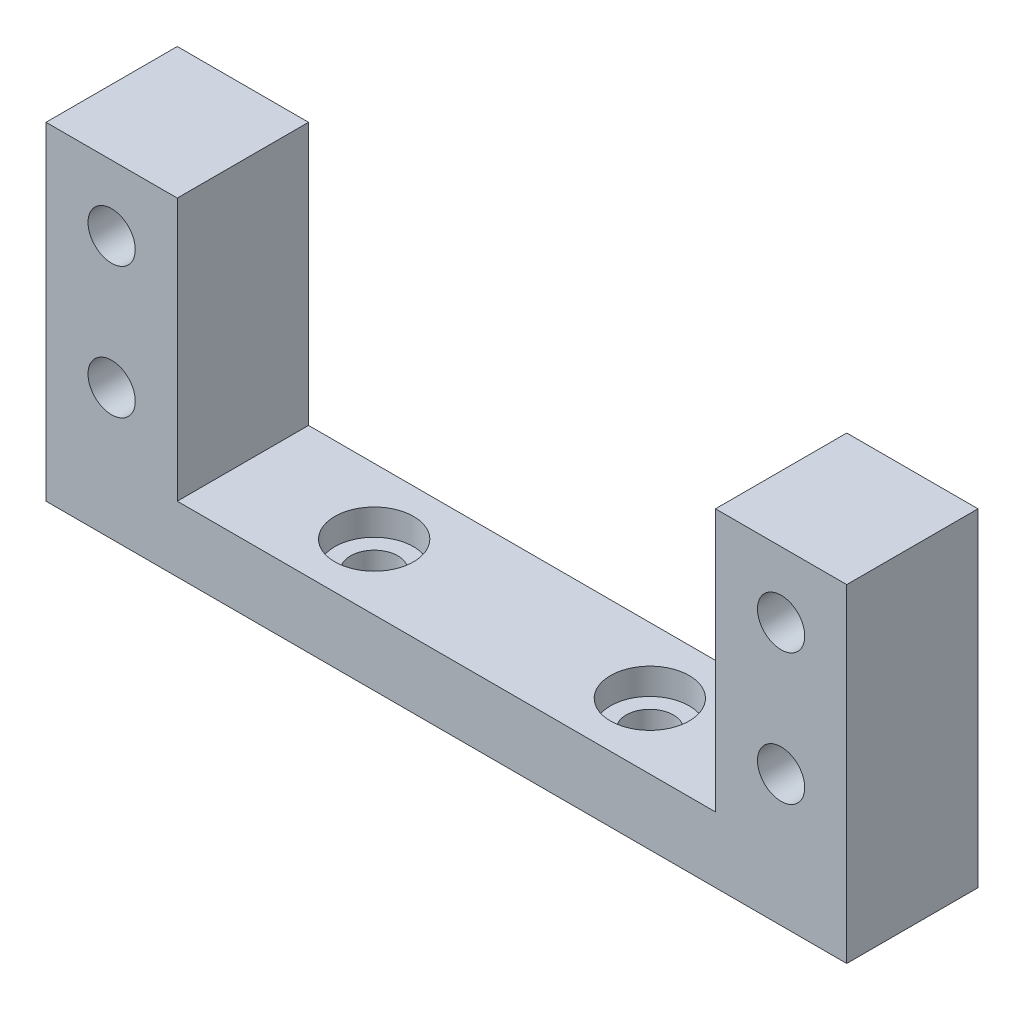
ISO-10303-21;
HEADER;
FILE_DESCRIPTION(('STEP AP214'),'2;1');
FILE_NAME('part.step','',(''),(''),'','','');
FILE_SCHEMA(('AUTOMOTIVE_DESIGN { 1 0 10303 214 1 1 1 1 }'));
ENDSEC;
DATA;
#1=APPLICATION_CONTEXT('core data for automotive mechanical design processes');
#2=APPLICATION_PROTOCOL_DEFINITION('international standard','automotive_design',2000,#1);
#3=PRODUCT_CONTEXT('',#1,'mechanical');
#4=PRODUCT('Part','Part','',(#3));
#5=PRODUCT_RELATED_PRODUCT_CATEGORY('part','',(#4));
#6=PRODUCT_DEFINITION_FORMATION('','',#4);
#7=PRODUCT_DEFINITION_CONTEXT('part definition',#1,'design');
#8=PRODUCT_DEFINITION('design','',#6,#7);
#9=PRODUCT_DEFINITION_SHAPE('','',#8);
#10=(LENGTH_UNIT() NAMED_UNIT(*) SI_UNIT(.MILLI.,.METRE.));
#11=(NAMED_UNIT(*) PLANE_ANGLE_UNIT() SI_UNIT($,.RADIAN.));
#12=(NAMED_UNIT(*) SI_UNIT($,.STERADIAN.) SOLID_ANGLE_UNIT());
#13=UNCERTAINTY_MEASURE_WITH_UNIT(LENGTH_MEASURE(1.E-05),#10,'distance_accuracy_value','');
#14=(GEOMETRIC_REPRESENTATION_CONTEXT(3) GLOBAL_UNCERTAINTY_ASSIGNED_CONTEXT((#13)) GLOBAL_UNIT_ASSIGNED_CONTEXT((#10,
#11,#12)) REPRESENTATION_CONTEXT('',''));
#15=CARTESIAN_POINT('',(0.,0.,0.));
#16=DIRECTION('',(0.,0.,1.));
#17=DIRECTION('',(1.,0.,0.));
#18=AXIS2_PLACEMENT_3D('',#15,#16,#17);
#19=CARTESIAN_POINT('',(31.,9.99999999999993,5.));
#20=DIRECTION('',(0.,-1.,0.));
#21=DIRECTION('',(1.,0.,0.));
#22=AXIS2_PLACEMENT_3D('',#19,#20,#21);
#23=CYLINDRICAL_SURFACE('',#22,1.8);
#24=CARTESIAN_POINT('',(31.,0.,5.));
#25=DIRECTION('',(0.,-1.,0.));
#26=DIRECTION('',(1.,0.,0.));
#27=AXIS2_PLACEMENT_3D('',#24,#25,#26);
#28=CIRCLE('',#27,1.8);
#29=CARTESIAN_POINT('',(32.8,0.,5.));
#30=VERTEX_POINT('',#29);
#31=EDGE_CURVE('E197',#30,#30,#28,.T.);
#32=ORIENTED_EDGE('',*,*,#31,.T.);
#33=EDGE_LOOP('',(#32));
#34=FACE_BOUND('',#33,.T.);
#35=CARTESIAN_POINT('',(31.,2.99999999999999,5.));
#36=DIRECTION('',(0.,1.,0.));
#37=DIRECTION('',(-1.,0.,0.));
#38=AXIS2_PLACEMENT_3D('',#35,#36,#37);
#39=CIRCLE('',#38,1.8);
#40=CARTESIAN_POINT('',(29.2,2.99999999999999,5.));
#41=VERTEX_POINT('',#40);
#42=EDGE_CURVE('E47',#41,#41,#39,.F.);
#43=ORIENTED_EDGE('',*,*,#42,.F.);
#44=EDGE_LOOP('',(#43));
#45=FACE_BOUND('',#44,.T.);
#46=ADVANCED_FACE('F43',(#34,#45),#23,.F.);
#47=CARTESIAN_POINT('',(10.,9.99999999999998,5.));
#48=DIRECTION('',(0.,-1.,0.));
#49=DIRECTION('',(1.,0.,0.));
#50=AXIS2_PLACEMENT_3D('',#47,#48,#49);
#51=CYLINDRICAL_SURFACE('',#50,1.8);
#52=CARTESIAN_POINT('',(9.99999999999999,0.,5.));
#53=DIRECTION('',(0.,-1.,0.));
#54=DIRECTION('',(1.,0.,0.));
#55=AXIS2_PLACEMENT_3D('',#52,#53,#54);
#56=CIRCLE('',#55,1.8);
#57=CARTESIAN_POINT('',(11.8,0.,5.));
#58=VERTEX_POINT('',#57);
#59=EDGE_CURVE('E154',#58,#58,#56,.T.);
#60=ORIENTED_EDGE('',*,*,#59,.T.);
#61=EDGE_LOOP('',(#60));
#62=FACE_BOUND('',#61,.T.);
#63=CARTESIAN_POINT('',(10.,3.,5.));
#64=DIRECTION('',(0.,1.,0.));
#65=DIRECTION('',(-1.,0.,0.));
#66=AXIS2_PLACEMENT_3D('',#63,#64,#65);
#67=CIRCLE('',#66,1.8);
#68=CARTESIAN_POINT('',(8.2,3.,5.));
#69=VERTEX_POINT('',#68);
#70=EDGE_CURVE('E191',#69,#69,#67,.F.);
#71=ORIENTED_EDGE('',*,*,#70,.F.);
#72=EDGE_LOOP('',(#71));
#73=FACE_BOUND('',#72,.T.);
#74=ADVANCED_FACE('F252',(#62,#73),#51,.F.);
#75=CARTESIAN_POINT('',(-9.99999999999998,0.,10.));
#76=DIRECTION('',(1.,0.,0.));
#77=DIRECTION('',(0.,0.,-1.));
#78=AXIS2_PLACEMENT_3D('',#75,#76,#77);
#79=PLANE('',#78);
#80=DIRECTION('',(0.,-1.,0.));
#81=VECTOR('',#80,1.);
#82=CARTESIAN_POINT('',(-9.99999999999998,0.,0.));
#83=LINE('',#82,#81);
#84=CARTESIAN_POINT('',(-9.99999999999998,25.,0.));
#85=VERTEX_POINT('',#84);
#86=CARTESIAN_POINT('',(-9.99999999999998,0.,0.));
#87=VERTEX_POINT('',#86);
#88=EDGE_CURVE('E157',#85,#87,#83,.T.);
#89=ORIENTED_EDGE('',*,*,#88,.T.);
#90=DIRECTION('',(0.,0.,-1.));
#91=VECTOR('',#90,1.);
#92=CARTESIAN_POINT('',(-9.99999999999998,0.,10.));
#93=LINE('',#92,#91);
#94=CARTESIAN_POINT('',(-9.99999999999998,0.,10.));
#95=VERTEX_POINT('',#94);
#96=EDGE_CURVE('E11',#95,#87,#93,.T.);
#97=ORIENTED_EDGE('',*,*,#96,.F.);
#98=DIRECTION('',(0.,-1.,0.));
#99=VECTOR('',#98,1.);
#100=CARTESIAN_POINT('',(-9.99999999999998,0.,10.));
#101=LINE('',#100,#99);
#102=CARTESIAN_POINT('',(-9.99999999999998,25.,10.));
#103=VERTEX_POINT('',#102);
#104=EDGE_CURVE('E221',#103,#95,#101,.T.);
#105=ORIENTED_EDGE('',*,*,#104,.F.);
#106=DIRECTION('',(0.,0.,-1.));
#107=VECTOR('',#106,1.);
#108=CARTESIAN_POINT('',(-9.99999999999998,25.,10.));
#109=LINE('',#108,#107);
#110=EDGE_CURVE('E62',#103,#85,#109,.T.);
#111=ORIENTED_EDGE('',*,*,#110,.T.);
#112=EDGE_LOOP('',(#89,#97,#105,#111));
#113=FACE_BOUND('',#112,.T.);
#114=ADVANCED_FACE('F258',(#113),#79,.F.);
#115=CARTESIAN_POINT('',(0.,0.,10.));
#116=DIRECTION('',(0.,1.,0.));
#117=DIRECTION('',(-1.,0.,0.));
#118=AXIS2_PLACEMENT_3D('',#115,#116,#117);
#119=PLANE('',#118);
#120=ORIENTED_EDGE('',*,*,#59,.F.);
#121=EDGE_LOOP('',(#120));
#122=FACE_BOUND('',#121,.T.);
#123=ORIENTED_EDGE('',*,*,#31,.F.);
#124=EDGE_LOOP('',(#123));
#125=FACE_BOUND('',#124,.T.);
#126=DIRECTION('',(1.,0.,0.));
#127=VECTOR('',#126,1.);
#128=CARTESIAN_POINT('',(0.,0.,0.));
#129=LINE('',#128,#127);
#130=CARTESIAN_POINT('',(51.,0.,0.));
#131=VERTEX_POINT('',#130);
#132=EDGE_CURVE('E159',#87,#131,#129,.T.);
#133=ORIENTED_EDGE('',*,*,#132,.T.);
#134=DIRECTION('',(0.,0.,-1.));
#135=VECTOR('',#134,1.);
#136=CARTESIAN_POINT('',(51.,0.,10.));
#137=LINE('',#136,#135);
#138=CARTESIAN_POINT('',(51.,0.,10.));
#139=VERTEX_POINT('',#138);
#140=EDGE_CURVE('E53',#139,#131,#137,.T.);
#141=ORIENTED_EDGE('',*,*,#140,.F.);
#142=DIRECTION('',(1.,0.,0.));
#143=VECTOR('',#142,1.);
#144=CARTESIAN_POINT('',(0.,0.,10.));
#145=LINE('',#144,#143);
#146=EDGE_CURVE('E100',#95,#139,#145,.T.);
#147=ORIENTED_EDGE('',*,*,#146,.F.);
#148=ORIENTED_EDGE('',*,*,#96,.T.);
#149=EDGE_LOOP('',(#133,#141,#147,#148));
#150=FACE_BOUND('',#149,.T.);
#151=ADVANCED_FACE('F452',(#122,#125,#150),#119,.F.);
#152=CARTESIAN_POINT('',(51.,0.,10.));
#153=DIRECTION('',(1.,0.,0.));
#154=DIRECTION('',(0.,1.,0.));
#155=AXIS2_PLACEMENT_3D('',#152,#153,#154);
#156=PLANE('',#155);
#157=DIRECTION('',(0.,-1.,0.));
#158=VECTOR('',#157,1.);
#159=CARTESIAN_POINT('',(51.,0.,0.));
#160=LINE('',#159,#158);
#161=CARTESIAN_POINT('',(51.,25.,0.));
#162=VERTEX_POINT('',#161);
#163=EDGE_CURVE('E162',#162,#131,#160,.T.);
#164=ORIENTED_EDGE('',*,*,#163,.F.);
#165=DIRECTION('',(0.,0.,-1.));
#166=VECTOR('',#165,1.);
#167=CARTESIAN_POINT('',(51.,25.,10.));
#168=LINE('',#167,#166);
#169=CARTESIAN_POINT('',(51.,25.,10.));
#170=VERTEX_POINT('',#169);
#171=EDGE_CURVE('E189',#170,#162,#168,.T.);
#172=ORIENTED_EDGE('',*,*,#171,.F.);
#173=DIRECTION('',(0.,-1.,0.));
#174=VECTOR('',#173,1.);
#175=CARTESIAN_POINT('',(51.,0.,10.));
#176=LINE('',#175,#174);
#177=EDGE_CURVE('E224',#170,#139,#176,.T.);
#178=ORIENTED_EDGE('',*,*,#177,.T.);
#179=ORIENTED_EDGE('',*,*,#140,.T.);
#180=EDGE_LOOP('',(#164,#172,#178,#179));
#181=FACE_BOUND('',#180,.T.);
#182=ADVANCED_FACE('F235',(#181),#156,.T.);
#183=CARTESIAN_POINT('',(0.,25.,10.));
#184=DIRECTION('',(0.,1.,0.));
#185=DIRECTION('',(0.,0.,1.));
#186=AXIS2_PLACEMENT_3D('',#183,#184,#185);
#187=PLANE('',#186);
#188=DIRECTION('',(1.,0.,0.));
#189=VECTOR('',#188,1.);
#190=CARTESIAN_POINT('',(0.,25.,0.));
#191=LINE('',#190,#189);
#192=CARTESIAN_POINT('',(41.,25.,0.));
#193=VERTEX_POINT('',#192);
#194=EDGE_CURVE('E165',#193,#162,#191,.T.);
#195=ORIENTED_EDGE('',*,*,#194,.F.);
#196=DIRECTION('',(0.,0.,-1.));
#197=VECTOR('',#196,1.);
#198=CARTESIAN_POINT('',(41.,25.,10.));
#199=LINE('',#198,#197);
#200=CARTESIAN_POINT('',(41.,25.,10.));
#201=VERTEX_POINT('',#200);
#202=EDGE_CURVE('E187',#201,#193,#199,.T.);
#203=ORIENTED_EDGE('',*,*,#202,.F.);
#204=DIRECTION('',(1.,0.,0.));
#205=VECTOR('',#204,1.);
#206=CARTESIAN_POINT('',(0.,25.,10.));
#207=LINE('',#206,#205);
#208=EDGE_CURVE('E227',#201,#170,#207,.T.);
#209=ORIENTED_EDGE('',*,*,#208,.T.);
#210=ORIENTED_EDGE('',*,*,#171,.T.);
#211=EDGE_LOOP('',(#195,#203,#209,#210));
#212=FACE_BOUND('',#211,.T.);
#213=ADVANCED_FACE('F231',(#212),#187,.T.);
#214=CARTESIAN_POINT('',(41.,0.,10.));
#215=DIRECTION('',(1.,0.,0.));
#216=DIRECTION('',(0.,1.,0.));
#217=AXIS2_PLACEMENT_3D('',#214,#215,#216);
#218=PLANE('',#217);
#219=DIRECTION('',(0.,-1.,0.));
#220=VECTOR('',#219,1.);
#221=CARTESIAN_POINT('',(41.,0.,0.));
#222=LINE('',#221,#220);
#223=CARTESIAN_POINT('',(41.,5.,0.));
#224=VERTEX_POINT('',#223);
#225=EDGE_CURVE('E168',#193,#224,#222,.T.);
#226=ORIENTED_EDGE('',*,*,#225,.T.);
#227=DIRECTION('',(0.,0.,-1.));
#228=VECTOR('',#227,1.);
#229=CARTESIAN_POINT('',(41.,5.,10.));
#230=LINE('',#229,#228);
#231=CARTESIAN_POINT('',(41.,5.,10.));
#232=VERTEX_POINT('',#231);
#233=EDGE_CURVE('E125',#232,#224,#230,.T.);
#234=ORIENTED_EDGE('',*,*,#233,.F.);
#235=DIRECTION('',(0.,-1.,0.));
#236=VECTOR('',#235,1.);
#237=CARTESIAN_POINT('',(41.,0.,10.));
#238=LINE('',#237,#236);
#239=EDGE_CURVE('E135',#201,#232,#238,.T.);
#240=ORIENTED_EDGE('',*,*,#239,.F.);
#241=ORIENTED_EDGE('',*,*,#202,.T.);
#242=EDGE_LOOP('',(#226,#234,#240,#241));
#243=FACE_BOUND('',#242,.T.);
#244=ADVANCED_FACE('F241',(#243),#218,.F.);
#245=CARTESIAN_POINT('',(0.,5.,10.));
#246=DIRECTION('',(0.,1.,0.));
#247=DIRECTION('',(-1.,0.,0.));
#248=AXIS2_PLACEMENT_3D('',#245,#246,#247);
#249=PLANE('',#248);
#250=CARTESIAN_POINT('',(10.,5.,5.));
#251=DIRECTION('',(0.,1.,0.));
#252=DIRECTION('',(-1.,0.,0.));
#253=AXIS2_PLACEMENT_3D('',#250,#251,#252);
#254=CIRCLE('',#253,3.);
#255=CARTESIAN_POINT('',(7.,5.,5.));
#256=VERTEX_POINT('',#255);
#257=EDGE_CURVE('E199',#256,#256,#254,.T.);
#258=ORIENTED_EDGE('',*,*,#257,.F.);
#259=EDGE_LOOP('',(#258));
#260=FACE_BOUND('',#259,.T.);
#261=CARTESIAN_POINT('',(31.,4.99999999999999,5.));
#262=DIRECTION('',(0.,1.,0.));
#263=DIRECTION('',(-1.,0.,0.));
#264=AXIS2_PLACEMENT_3D('',#261,#262,#263);
#265=CIRCLE('',#264,3.);
#266=CARTESIAN_POINT('',(28.,4.99999999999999,5.));
#267=VERTEX_POINT('',#266);
#268=EDGE_CURVE('E204',#267,#267,#265,.T.);
#269=ORIENTED_EDGE('',*,*,#268,.F.);
#270=EDGE_LOOP('',(#269));
#271=FACE_BOUND('',#270,.T.);
#272=DIRECTION('',(1.,0.,0.));
#273=VECTOR('',#272,1.);
#274=CARTESIAN_POINT('',(0.,5.,0.));
#275=LINE('',#274,#273);
#276=CARTESIAN_POINT('',(0.,5.,0.));
#277=VERTEX_POINT('',#276);
#278=EDGE_CURVE('E121',#277,#224,#275,.T.);
#279=ORIENTED_EDGE('',*,*,#278,.F.);
#280=DIRECTION('',(0.,0.,-1.));
#281=VECTOR('',#280,1.);
#282=CARTESIAN_POINT('',(0.,5.,10.));
#283=LINE('',#282,#281);
#284=CARTESIAN_POINT('',(0.,5.,10.));
#285=VERTEX_POINT('',#284);
#286=EDGE_CURVE('E116',#285,#277,#283,.T.);
#287=ORIENTED_EDGE('',*,*,#286,.F.);
#288=DIRECTION('',(1.,0.,0.));
#289=VECTOR('',#288,1.);
#290=CARTESIAN_POINT('',(0.,5.,10.));
#291=LINE('',#290,#289);
#292=EDGE_CURVE('E119',#285,#232,#291,.T.);
#293=ORIENTED_EDGE('',*,*,#292,.T.);
#294=ORIENTED_EDGE('',*,*,#233,.T.);
#295=EDGE_LOOP('',(#279,#287,#293,#294));
#296=FACE_BOUND('',#295,.T.);
#297=ADVANCED_FACE('F118',(#260,#271,#296),#249,.T.);
#298=CARTESIAN_POINT('',(0.,0.,10.));
#299=DIRECTION('',(1.,0.,0.));
#300=DIRECTION('',(0.,1.,0.));
#301=AXIS2_PLACEMENT_3D('',#298,#299,#300);
#302=PLANE('',#301);
#303=DIRECTION('',(0.,-1.,0.));
#304=VECTOR('',#303,1.);
#305=CARTESIAN_POINT('',(0.,0.,0.));
#306=LINE('',#305,#304);
#307=CARTESIAN_POINT('',(0.,25.,0.));
#308=VERTEX_POINT('',#307);
#309=EDGE_CURVE('E172',#308,#277,#306,.T.);
#310=ORIENTED_EDGE('',*,*,#309,.F.);
#311=DIRECTION('',(0.,0.,-1.));
#312=VECTOR('',#311,1.);
#313=CARTESIAN_POINT('',(0.,25.,10.));
#314=LINE('',#313,#312);
#315=CARTESIAN_POINT('',(0.,25.,10.));
#316=VERTEX_POINT('',#315);
#317=EDGE_CURVE('E88',#316,#308,#314,.T.);
#318=ORIENTED_EDGE('',*,*,#317,.F.);
#319=DIRECTION('',(0.,-1.,0.));
#320=VECTOR('',#319,1.);
#321=CARTESIAN_POINT('',(0.,0.,10.));
#322=LINE('',#321,#320);
#323=EDGE_CURVE('E132',#316,#285,#322,.T.);
#324=ORIENTED_EDGE('',*,*,#323,.T.);
#325=ORIENTED_EDGE('',*,*,#286,.T.);
#326=EDGE_LOOP('',(#310,#318,#324,#325));
#327=FACE_BOUND('',#326,.T.);
#328=ADVANCED_FACE('F138',(#327),#302,.T.);
#329=CARTESIAN_POINT('',(46.,9.99999999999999,10.));
#330=DIRECTION('',(0.,0.,-1.));
#331=DIRECTION('',(-1.,0.,0.));
#332=AXIS2_PLACEMENT_3D('',#329,#330,#331);
#333=CYLINDRICAL_SURFACE('',#332,1.8);
#334=CARTESIAN_POINT('',(46.,9.99999999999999,10.));
#335=DIRECTION('',(0.,0.,1.));
#336=DIRECTION('',(1.,0.,0.));
#337=AXIS2_PLACEMENT_3D('',#334,#335,#336);
#338=CIRCLE('',#337,1.8);
#339=CARTESIAN_POINT('',(47.8,9.99999999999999,10.));
#340=VERTEX_POINT('',#339);
#341=EDGE_CURVE('E141',#340,#340,#338,.T.);
#342=ORIENTED_EDGE('',*,*,#341,.T.);
#343=EDGE_LOOP('',(#342));
#344=FACE_BOUND('',#343,.T.);
#345=CARTESIAN_POINT('',(46.,9.99999999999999,0.));
#346=DIRECTION('',(0.,0.,1.));
#347=DIRECTION('',(1.,0.,0.));
#348=AXIS2_PLACEMENT_3D('',#345,#346,#347);
#349=CIRCLE('',#348,1.8);
#350=CARTESIAN_POINT('',(47.8,9.99999999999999,0.));
#351=VERTEX_POINT('',#350);
#352=EDGE_CURVE('E177',#351,#351,#349,.T.);
#353=ORIENTED_EDGE('',*,*,#352,.F.);
#354=EDGE_LOOP('',(#353));
#355=FACE_BOUND('',#354,.T.);
#356=ADVANCED_FACE('F275',(#344,#355),#333,.F.);
#357=CARTESIAN_POINT('',(0.,25.,10.));
#358=DIRECTION('',(0.,1.,0.));
#359=DIRECTION('',(-1.,0.,0.));
#360=AXIS2_PLACEMENT_3D('',#357,#358,#359);
#361=PLANE('',#360);
#362=DIRECTION('',(1.,0.,0.));
#363=VECTOR('',#362,1.);
#364=CARTESIAN_POINT('',(0.,25.,0.));
#365=LINE('',#364,#363);
#366=EDGE_CURVE('E174',#85,#308,#365,.T.);
#367=ORIENTED_EDGE('',*,*,#366,.F.);
#368=ORIENTED_EDGE('',*,*,#110,.F.);
#369=DIRECTION('',(1.,0.,0.));
#370=VECTOR('',#369,1.);
#371=CARTESIAN_POINT('',(0.,25.,10.));
#372=LINE('',#371,#370);
#373=EDGE_CURVE('E139',#103,#316,#372,.T.);
#374=ORIENTED_EDGE('',*,*,#373,.T.);
#375=ORIENTED_EDGE('',*,*,#317,.T.);
#376=EDGE_LOOP('',(#367,#368,#374,#375));
#377=FACE_BOUND('',#376,.T.);
#378=ADVANCED_FACE('F278',(#377),#361,.T.);
#379=CARTESIAN_POINT('',(-5.,20.,10.));
#380=DIRECTION('',(0.,0.,-1.));
#381=DIRECTION('',(-1.,0.,0.));
#382=AXIS2_PLACEMENT_3D('',#379,#380,#381);
#383=CYLINDRICAL_SURFACE('',#382,1.8);
#384=CARTESIAN_POINT('',(-5.,20.,10.));
#385=DIRECTION('',(0.,0.,1.));
#386=DIRECTION('',(1.,0.,0.));
#387=AXIS2_PLACEMENT_3D('',#384,#385,#386);
#388=CIRCLE('',#387,1.8);
#389=CARTESIAN_POINT('',(-3.2,20.,10.));
#390=VERTEX_POINT('',#389);
#391=EDGE_CURVE('E218',#390,#390,#388,.T.);
#392=ORIENTED_EDGE('',*,*,#391,.T.);
#393=EDGE_LOOP('',(#392));
#394=FACE_BOUND('',#393,.T.);
#395=CARTESIAN_POINT('',(-5.,20.,0.));
#396=DIRECTION('',(0.,0.,1.));
#397=DIRECTION('',(1.,0.,0.));
#398=AXIS2_PLACEMENT_3D('',#395,#396,#397);
#399=CIRCLE('',#398,1.8);
#400=CARTESIAN_POINT('',(-3.2,20.,0.));
#401=VERTEX_POINT('',#400);
#402=EDGE_CURVE('E153',#401,#401,#399,.T.);
#403=ORIENTED_EDGE('',*,*,#402,.F.);
#404=EDGE_LOOP('',(#403));
#405=FACE_BOUND('',#404,.T.);
#406=ADVANCED_FACE('F282',(#394,#405),#383,.F.);
#407=CARTESIAN_POINT('',(-5.,10.,10.));
#408=DIRECTION('',(0.,0.,-1.));
#409=DIRECTION('',(-1.,0.,0.));
#410=AXIS2_PLACEMENT_3D('',#407,#408,#409);
#411=CYLINDRICAL_SURFACE('',#410,1.8);
#412=CARTESIAN_POINT('',(-5.,10.,10.));
#413=DIRECTION('',(0.,0.,1.));
#414=DIRECTION('',(1.,0.,0.));
#415=AXIS2_PLACEMENT_3D('',#412,#413,#414);
#416=CIRCLE('',#415,1.8);
#417=CARTESIAN_POINT('',(-3.2,10.,10.));
#418=VERTEX_POINT('',#417);
#419=EDGE_CURVE('E183',#418,#418,#416,.T.);
#420=ORIENTED_EDGE('',*,*,#419,.T.);
#421=EDGE_LOOP('',(#420));
#422=FACE_BOUND('',#421,.T.);
#423=CARTESIAN_POINT('',(-5.,10.,0.));
#424=DIRECTION('',(0.,0.,1.));
#425=DIRECTION('',(1.,0.,0.));
#426=AXIS2_PLACEMENT_3D('',#423,#424,#425);
#427=CIRCLE('',#426,1.8);
#428=CARTESIAN_POINT('',(-3.2,10.,0.));
#429=VERTEX_POINT('',#428);
#430=EDGE_CURVE('E150',#429,#429,#427,.T.);
#431=ORIENTED_EDGE('',*,*,#430,.F.);
#432=EDGE_LOOP('',(#431));
#433=FACE_BOUND('',#432,.T.);
#434=ADVANCED_FACE('F45',(#422,#433),#411,.F.);
#435=CARTESIAN_POINT('',(46.,20.,10.));
#436=DIRECTION('',(0.,0.,-1.));
#437=DIRECTION('',(-1.,0.,0.));
#438=AXIS2_PLACEMENT_3D('',#435,#436,#437);
#439=CYLINDRICAL_SURFACE('',#438,1.8);
#440=CARTESIAN_POINT('',(46.,20.,10.));
#441=DIRECTION('',(0.,0.,1.));
#442=DIRECTION('',(1.,0.,0.));
#443=AXIS2_PLACEMENT_3D('',#440,#441,#442);
#444=CIRCLE('',#443,1.8);
#445=CARTESIAN_POINT('',(47.8,20.,10.));
#446=VERTEX_POINT('',#445);
#447=EDGE_CURVE('E147',#446,#446,#444,.T.);
#448=ORIENTED_EDGE('',*,*,#447,.T.);
#449=EDGE_LOOP('',(#448));
#450=FACE_BOUND('',#449,.T.);
#451=CARTESIAN_POINT('',(46.,20.,0.));
#452=DIRECTION('',(0.,0.,1.));
#453=DIRECTION('',(1.,0.,0.));
#454=AXIS2_PLACEMENT_3D('',#451,#452,#453);
#455=CIRCLE('',#454,1.8);
#456=CARTESIAN_POINT('',(47.8,20.,0.));
#457=VERTEX_POINT('',#456);
#458=EDGE_CURVE('E180',#457,#457,#455,.T.);
#459=ORIENTED_EDGE('',*,*,#458,.F.);
#460=EDGE_LOOP('',(#459));
#461=FACE_BOUND('',#460,.T.);
#462=ADVANCED_FACE('F266',(#450,#461),#439,.F.);
#463=CARTESIAN_POINT('',(0.,0.,10.));
#464=DIRECTION('',(0.,0.,1.));
#465=DIRECTION('',(1.,0.,0.));
#466=AXIS2_PLACEMENT_3D('',#463,#464,#465);
#467=PLANE('',#466);
#468=ORIENTED_EDGE('',*,*,#419,.F.);
#469=EDGE_LOOP('',(#468));
#470=FACE_BOUND('',#469,.T.);
#471=ORIENTED_EDGE('',*,*,#391,.F.);
#472=EDGE_LOOP('',(#471));
#473=FACE_BOUND('',#472,.T.);
#474=ORIENTED_EDGE('',*,*,#104,.T.);
#475=ORIENTED_EDGE('',*,*,#146,.T.);
#476=ORIENTED_EDGE('',*,*,#177,.F.);
#477=ORIENTED_EDGE('',*,*,#208,.F.);
#478=ORIENTED_EDGE('',*,*,#239,.T.);
#479=ORIENTED_EDGE('',*,*,#292,.F.);
#480=ORIENTED_EDGE('',*,*,#323,.F.);
#481=ORIENTED_EDGE('',*,*,#373,.F.);
#482=EDGE_LOOP('',(#474,#475,#476,#477,#478,#479,#480,#481));
#483=FACE_BOUND('',#482,.T.);
#484=ORIENTED_EDGE('',*,*,#341,.F.);
#485=EDGE_LOOP('',(#484));
#486=FACE_BOUND('',#485,.T.);
#487=ORIENTED_EDGE('',*,*,#447,.F.);
#488=EDGE_LOOP('',(#487));
#489=FACE_BOUND('',#488,.T.);
#490=ADVANCED_FACE('F129',(#470,#473,#483,#486,#489),#467,.T.);
#491=CARTESIAN_POINT('',(0.,0.,0.));
#492=DIRECTION('',(0.,0.,1.));
#493=DIRECTION('',(1.,0.,0.));
#494=AXIS2_PLACEMENT_3D('',#491,#492,#493);
#495=PLANE('',#494);
#496=ORIENTED_EDGE('',*,*,#430,.T.);
#497=EDGE_LOOP('',(#496));
#498=FACE_BOUND('',#497,.T.);
#499=ORIENTED_EDGE('',*,*,#402,.T.);
#500=EDGE_LOOP('',(#499));
#501=FACE_BOUND('',#500,.T.);
#502=ORIENTED_EDGE('',*,*,#88,.F.);
#503=ORIENTED_EDGE('',*,*,#366,.T.);
#504=ORIENTED_EDGE('',*,*,#309,.T.);
#505=ORIENTED_EDGE('',*,*,#278,.T.);
#506=ORIENTED_EDGE('',*,*,#225,.F.);
#507=ORIENTED_EDGE('',*,*,#194,.T.);
#508=ORIENTED_EDGE('',*,*,#163,.T.);
#509=ORIENTED_EDGE('',*,*,#132,.F.);
#510=EDGE_LOOP('',(#502,#503,#504,#505,#506,#507,#508,#509));
#511=FACE_BOUND('',#510,.T.);
#512=ORIENTED_EDGE('',*,*,#352,.T.);
#513=EDGE_LOOP('',(#512));
#514=FACE_BOUND('',#513,.T.);
#515=ORIENTED_EDGE('',*,*,#458,.T.);
#516=EDGE_LOOP('',(#515));
#517=FACE_BOUND('',#516,.T.);
#518=ADVANCED_FACE('F238',(#498,#501,#511,#514,#517),#495,.F.);
#519=CARTESIAN_POINT('',(10.,3.,5.));
#520=DIRECTION('',(0.,1.,0.));
#521=DIRECTION('',(-1.,0.,0.));
#522=AXIS2_PLACEMENT_3D('',#519,#520,#521);
#523=PLANE('',#522);
#524=CARTESIAN_POINT('',(10.,3.,5.));
#525=DIRECTION('',(0.,1.,0.));
#526=DIRECTION('',(-1.,0.,0.));
#527=AXIS2_PLACEMENT_3D('',#524,#525,#526);
#528=CIRCLE('',#527,3.);
#529=CARTESIAN_POINT('',(7.,3.,5.));
#530=VERTEX_POINT('',#529);
#531=EDGE_CURVE('E193',#530,#530,#528,.T.);
#532=ORIENTED_EDGE('',*,*,#531,.T.);
#533=EDGE_LOOP('',(#532));
#534=FACE_BOUND('',#533,.T.);
#535=ORIENTED_EDGE('',*,*,#70,.T.);
#536=EDGE_LOOP('',(#535));
#537=FACE_BOUND('',#536,.T.);
#538=ADVANCED_FACE('F270',(#534,#537),#523,.T.);
#539=CARTESIAN_POINT('',(10.,3.,5.));
#540=DIRECTION('',(0.,1.,0.));
#541=DIRECTION('',(-1.,0.,0.));
#542=AXIS2_PLACEMENT_3D('',#539,#540,#541);
#543=CYLINDRICAL_SURFACE('',#542,3.);
#544=ORIENTED_EDGE('',*,*,#531,.F.);
#545=EDGE_LOOP('',(#544));
#546=FACE_BOUND('',#545,.T.);
#547=ORIENTED_EDGE('',*,*,#257,.T.);
#548=EDGE_LOOP('',(#547));
#549=FACE_BOUND('',#548,.T.);
#550=ADVANCED_FACE('F327',(#546,#549),#543,.F.);
#551=CARTESIAN_POINT('',(31.,2.99999999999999,5.));
#552=DIRECTION('',(0.,1.,0.));
#553=DIRECTION('',(-1.,0.,0.));
#554=AXIS2_PLACEMENT_3D('',#551,#552,#553);
#555=PLANE('',#554);
#556=CARTESIAN_POINT('',(31.,2.99999999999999,5.));
#557=DIRECTION('',(0.,1.,0.));
#558=DIRECTION('',(-1.,0.,0.));
#559=AXIS2_PLACEMENT_3D('',#556,#557,#558);
#560=CIRCLE('',#559,3.);
#561=CARTESIAN_POINT('',(28.,2.99999999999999,5.));
#562=VERTEX_POINT('',#561);
#563=EDGE_CURVE('E209',#562,#562,#560,.T.);
#564=ORIENTED_EDGE('',*,*,#563,.T.);
#565=EDGE_LOOP('',(#564));
#566=FACE_BOUND('',#565,.T.);
#567=ORIENTED_EDGE('',*,*,#42,.T.);
#568=EDGE_LOOP('',(#567));
#569=FACE_BOUND('',#568,.T.);
#570=ADVANCED_FACE('F334',(#566,#569),#555,.T.);
#571=CARTESIAN_POINT('',(31.,2.99999999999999,5.));
#572=DIRECTION('',(0.,1.,0.));
#573=DIRECTION('',(-1.,0.,0.));
#574=AXIS2_PLACEMENT_3D('',#571,#572,#573);
#575=CYLINDRICAL_SURFACE('',#574,3.);
#576=ORIENTED_EDGE('',*,*,#563,.F.);
#577=EDGE_LOOP('',(#576));
#578=FACE_BOUND('',#577,.T.);
#579=ORIENTED_EDGE('',*,*,#268,.T.);
#580=EDGE_LOOP('',(#579));
#581=FACE_BOUND('',#580,.T.);
#582=ADVANCED_FACE('F342',(#578,#581),#575,.F.);
#583=CLOSED_SHELL('',(#46,#74,#114,#151,#182,#213,#244,#297,#328,#356,#378,#406,#434,#462,#490,
#518,#538,#550,#570,#582));
#584=MANIFOLD_SOLID_BREP('B2',#583);
#585=ADVANCED_BREP_SHAPE_REPRESENTATION('',(#18,#584),#14);
#586=SHAPE_DEFINITION_REPRESENTATION(#9,#585);
ENDSEC;
END-ISO-10303-21;
